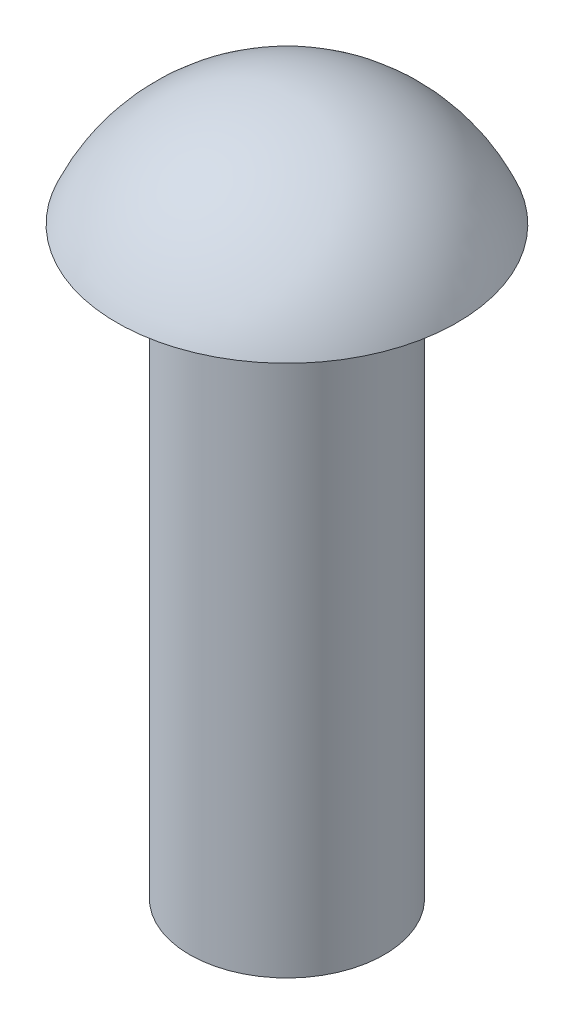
from build123d import *

# Parameters (mm, degrees)
SKETCH2_R      = 2
EXTRUDE1_DEPTH = 12


with BuildPart() as part:
    # Sketch1 → Revolve1 (revolve)
    with BuildSketch(Plane(origin=(0, 0, 0), x_dir=(0, 0, -1), z_dir=(1, 0, 0))):
        with BuildLine():
            Line((0, 0), (3.5, 0))
            ThreePointArc((3.5, 0), (2.099584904, 1.68742787), (0, 2.320135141))
            Line((0, 2.320135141), (0, 0))
        make_face()
    revolve(axis=Axis((0, -3.105310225, 0), (0, 1, 0)))

    # Sketch2 → Extrude1 (add)
    with BuildSketch(Plane.XZ):
        with Locations(Location((0, 0, 0), (0, 0, 270))):
            Circle(SKETCH2_R)
    extrude(amount=EXTRUDE1_DEPTH)


solid = part.part
